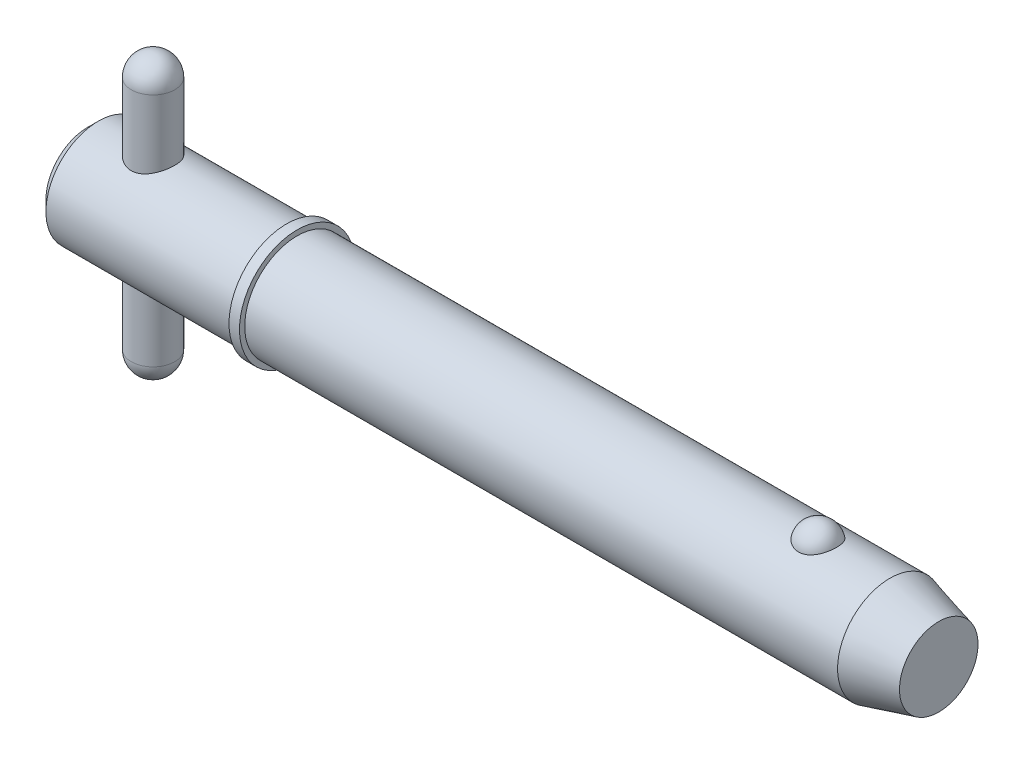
ISO-10303-21;
HEADER;
FILE_DESCRIPTION(('STEP AP214'),'2;1');
FILE_NAME('part.step','',(''),(''),'','','');
FILE_SCHEMA(('AUTOMOTIVE_DESIGN { 1 0 10303 214 1 1 1 1 }'));
ENDSEC;
DATA;
#1=APPLICATION_CONTEXT('core data for automotive mechanical design processes');
#2=APPLICATION_PROTOCOL_DEFINITION('international standard','automotive_design',2000,#1);
#3=PRODUCT_CONTEXT('',#1,'mechanical');
#4=PRODUCT('Part','Part','',(#3));
#5=PRODUCT_RELATED_PRODUCT_CATEGORY('part','',(#4));
#6=PRODUCT_DEFINITION_FORMATION('','',#4);
#7=PRODUCT_DEFINITION_CONTEXT('part definition',#1,'design');
#8=PRODUCT_DEFINITION('design','',#6,#7);
#9=PRODUCT_DEFINITION_SHAPE('','',#8);
#10=(LENGTH_UNIT() NAMED_UNIT(*) SI_UNIT(.MILLI.,.METRE.));
#11=(NAMED_UNIT(*) PLANE_ANGLE_UNIT() SI_UNIT($,.RADIAN.));
#12=(NAMED_UNIT(*) SI_UNIT($,.STERADIAN.) SOLID_ANGLE_UNIT());
#13=UNCERTAINTY_MEASURE_WITH_UNIT(LENGTH_MEASURE(1.E-05),#10,'distance_accuracy_value','');
#14=(GEOMETRIC_REPRESENTATION_CONTEXT(3) GLOBAL_UNCERTAINTY_ASSIGNED_CONTEXT((#13)) GLOBAL_UNIT_ASSIGNED_CONTEXT((#10,
#11,#12)) REPRESENTATION_CONTEXT('',''));
#15=CARTESIAN_POINT('',(0.,0.,0.));
#16=DIRECTION('',(0.,0.,1.));
#17=DIRECTION('',(1.,0.,0.));
#18=AXIS2_PLACEMENT_3D('',#15,#16,#17);
#19=CARTESIAN_POINT('',(5.94,12.7,0.));
#20=DIRECTION('',(0.,-1.,0.));
#21=DIRECTION('',(0.,0.,-1.));
#22=AXIS2_PLACEMENT_3D('',#19,#20,#21);
#23=CYLINDRICAL_SURFACE('',#22,1.98);
#24=CARTESIAN_POINT('',(5.94,-10.72,0.));
#25=DIRECTION('',(0.,-1.,0.));
#26=DIRECTION('',(0.,0.,-1.));
#27=AXIS2_PLACEMENT_3D('',#24,#25,#26);
#28=CIRCLE('',#27,1.98);
#29=CARTESIAN_POINT('',(5.94,-10.72,-1.98));
#30=VERTEX_POINT('',#29);
#31=EDGE_CURVE('P0_E10',#30,#30,#28,.F.);
#32=ORIENTED_EDGE('',*,*,#31,.T.);
#33=EDGE_LOOP('',(#32));
#34=FACE_BOUND('',#33,.T.);
#35=CARTESIAN_POINT('',(5.94,10.72,0.));
#36=DIRECTION('',(0.,-1.,0.));
#37=DIRECTION('',(0.,0.,-1.));
#38=AXIS2_PLACEMENT_3D('',#35,#36,#37);
#39=CIRCLE('',#38,1.98);
#40=CARTESIAN_POINT('',(5.94,10.72,-1.98));
#41=VERTEX_POINT('',#40);
#42=EDGE_CURVE('P0_E21',#41,#41,#39,.T.);
#43=ORIENTED_EDGE('',*,*,#42,.T.);
#44=EDGE_LOOP('',(#43));
#45=FACE_BOUND('',#44,.T.);
#46=ADVANCED_FACE('P0_F14',(#34,#45),#23,.T.);
#47=CARTESIAN_POINT('',(5.94,-10.72,0.));
#48=DIRECTION('',(0.,0.,1.));
#49=DIRECTION('',(1.,0.,0.));
#50=AXIS2_PLACEMENT_3D('',#47,#48,#49);
#51=SPHERICAL_SURFACE('',#50,1.98);
#52=CARTESIAN_POINT('',(5.94,-10.72,0.));
#53=DIRECTION('',(0.,-1.,0.));
#54=DIRECTION('',(0.,0.,-1.));
#55=AXIS2_PLACEMENT_3D('',#52,#53,#54);
#56=SPHERICAL_SURFACE('',#55,1.98);
#57=ORIENTED_EDGE('',*,*,#31,.F.);
#58=EDGE_LOOP('',(#57));
#59=FACE_BOUND('',#58,.T.);
#60=ADVANCED_FACE('P0_F29',(#59),#56,.T.);
#61=CARTESIAN_POINT('',(5.94,10.72,0.));
#62=DIRECTION('',(0.,0.,1.));
#63=DIRECTION('',(1.,0.,0.));
#64=AXIS2_PLACEMENT_3D('',#61,#62,#63);
#65=SPHERICAL_SURFACE('',#64,1.98);
#66=CARTESIAN_POINT('',(5.94,10.72,0.));
#67=DIRECTION('',(0.,-1.,0.));
#68=DIRECTION('',(0.,0.,-1.));
#69=AXIS2_PLACEMENT_3D('',#66,#67,#68);
#70=SPHERICAL_SURFACE('',#69,1.98);
#71=ORIENTED_EDGE('',*,*,#42,.F.);
#72=EDGE_LOOP('',(#71));
#73=FACE_BOUND('',#72,.T.);
#74=ADVANCED_FACE('P0_F16',(#73),#70,.T.);
#75=CLOSED_SHELL('',(#46,#60,#74));
#76=MANIFOLD_SOLID_BREP('P0_B1',#75);
#77=CARTESIAN_POINT('',(0.,0.,0.));
#78=DIRECTION('',(1.,0.,0.));
#79=DIRECTION('',(0.,0.,-1.));
#80=AXIS2_PLACEMENT_3D('',#77,#78,#79);
#81=CYLINDRICAL_SURFACE('',#80,4.765);
#82=CARTESIAN_POINT('',(73.0241944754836,0.,0.));
#83=DIRECTION('',(1.,0.,0.));
#84=DIRECTION('',(0.,0.,-1.));
#85=AXIS2_PLACEMENT_3D('',#82,#83,#84);
#86=CIRCLE('',#85,4.765);
#87=CARTESIAN_POINT('',(73.0241944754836,0.,-4.765));
#88=VERTEX_POINT('',#87);
#89=EDGE_CURVE('P1_E81',#88,#88,#86,.T.);
#90=ORIENTED_EDGE('',*,*,#89,.F.);
#91=EDGE_LOOP('',(#90));
#92=FACE_BOUND('',#91,.T.);
#93=CARTESIAN_POINT('',(19.05,0.,0.));
#94=DIRECTION('',(1.,0.,0.));
#95=DIRECTION('',(0.,0.,-1.));
#96=AXIS2_PLACEMENT_3D('',#93,#94,#95);
#97=CIRCLE('',#96,4.765);
#98=CARTESIAN_POINT('',(19.05,0.,-4.765));
#99=VERTEX_POINT('',#98);
#100=EDGE_CURVE('P1_E85',#99,#99,#97,.T.);
#101=ORIENTED_EDGE('',*,*,#100,.T.);
#102=EDGE_LOOP('',(#101));
#103=FACE_BOUND('',#102,.T.);
#104=CARTESIAN_POINT('',(66.471020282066,4.42764777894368,1.76101111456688));
#105=CARTESIAN_POINT('',(66.3797212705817,4.42764470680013,1.76101422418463));
#106=CARTESIAN_POINT('',(66.2884468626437,4.43059091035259,1.75366340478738));
#107=CARTESIAN_POINT('',(66.108615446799,4.44201846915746,1.72451180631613));
#108=CARTESIAN_POINT('',(66.0200577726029,4.45049845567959,1.70271460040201));
#109=CARTESIAN_POINT('',(65.8482570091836,4.47200516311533,1.6453937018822));
#110=CARTESIAN_POINT('',(65.7650064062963,4.48502527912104,1.60988994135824));
#111=CARTESIAN_POINT('',(65.6057633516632,4.51419542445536,1.52617873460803));
#112=CARTESIAN_POINT('',(65.5297723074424,4.53034605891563,1.47796883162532));
#113=CARTESIAN_POINT('',(65.3847445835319,4.5645931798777,1.36860494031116));
#114=CARTESIAN_POINT('',(65.3159645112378,4.58273170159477,1.30712420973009));
#115=CARTESIAN_POINT('',(65.1893423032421,4.61870302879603,1.1737020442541));
#116=CARTESIAN_POINT('',(65.1315021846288,4.63653577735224,1.1017586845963));
#117=CARTESIAN_POINT('',(65.0255709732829,4.67090140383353,0.945806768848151));
#118=CARTESIAN_POINT('',(64.9780305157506,4.68734068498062,0.861402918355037));
#119=CARTESIAN_POINT('',(64.8970817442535,4.71628466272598,0.685442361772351));
#120=CARTESIAN_POINT('',(64.8636747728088,4.72878898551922,0.593884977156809));
#121=CARTESIAN_POINT('',(64.811287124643,4.74874061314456,0.404781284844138));
#122=CARTESIAN_POINT('',(64.7925178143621,4.75611366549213,0.30716844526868));
#123=CARTESIAN_POINT('',(64.7705846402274,4.76475393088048,0.109940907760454));
#124=CARTESIAN_POINT('',(64.7674205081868,4.76602124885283,0.0103262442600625));
#125=CARTESIAN_POINT('',(64.7767405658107,4.76232928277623,-0.187629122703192));
#126=CARTESIAN_POINT('',(64.7891588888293,4.7573962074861,-0.285973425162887));
#127=CARTESIAN_POINT('',(64.8292804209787,4.74184975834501,-0.47902728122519));
#128=CARTESIAN_POINT('',(64.8569839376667,4.7312362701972,-0.573736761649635));
#129=CARTESIAN_POINT('',(64.9271581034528,4.70540026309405,-0.756973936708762));
#130=CARTESIAN_POINT('',(64.9696460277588,4.69017235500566,-0.845494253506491));
#131=CARTESIAN_POINT('',(65.068520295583,4.6566986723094,-1.01378033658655));
#132=CARTESIAN_POINT('',(65.1249076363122,4.63845268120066,-1.09354547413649));
#133=CARTESIAN_POINT('',(65.250552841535,4.60085438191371,-1.24228523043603));
#134=CARTESIAN_POINT('',(65.3198439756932,4.58149930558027,-1.31123108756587));
#135=CARTESIAN_POINT('',(65.4696066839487,4.54391653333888,-1.43607409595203));
#136=CARTESIAN_POINT('',(65.5500771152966,4.52568872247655,-1.49197257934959));
#137=CARTESIAN_POINT('',(65.7181500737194,4.49293007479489,-1.58786764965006));
#138=CARTESIAN_POINT('',(65.8055445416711,4.47832346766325,-1.62820219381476));
#139=CARTESIAN_POINT('',(65.9865534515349,4.45406011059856,-1.69345757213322));
#140=CARTESIAN_POINT('',(66.0801655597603,4.44440151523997,-1.71838415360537));
#141=CARTESIAN_POINT('',(66.2658939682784,4.43159888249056,-1.75112843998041));
#142=CARTESIAN_POINT('',(66.357849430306,4.42815213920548,-1.75974223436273));
#143=CARTESIAN_POINT('',(66.5419658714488,4.427247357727,-1.76201865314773));
#144=CARTESIAN_POINT('',(66.6341268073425,4.42978816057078,-1.7556841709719));
#145=CARTESIAN_POINT('',(66.8131292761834,4.4403864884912,-1.72869560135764));
#146=CARTESIAN_POINT('',(66.9000474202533,4.44827555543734,-1.70847853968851));
#147=CARTESIAN_POINT('',(67.0691314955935,4.46852246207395,-1.65479562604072));
#148=CARTESIAN_POINT('',(67.1512970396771,4.48088066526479,-1.62132869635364));
#149=CARTESIAN_POINT('',(67.3105916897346,4.50907357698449,-1.54120560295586));
#150=CARTESIAN_POINT('',(67.3875700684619,4.52497884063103,-1.49427526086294));
#151=CARTESIAN_POINT('',(67.5327080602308,4.55845148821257,-1.38881222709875));
#152=CARTESIAN_POINT('',(67.6008656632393,4.57601924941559,-1.33027689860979));
#153=CARTESIAN_POINT('',(67.7300990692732,4.61196537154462,-1.19991049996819));
#154=CARTESIAN_POINT('',(67.7906562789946,4.63034074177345,-1.12756415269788));
#155=CARTESIAN_POINT('',(67.8992797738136,4.66513959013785,-0.973612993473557));
#156=CARTESIAN_POINT('',(67.9473438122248,4.68156271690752,-0.892006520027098));
#157=CARTESIAN_POINT('',(68.031383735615,4.71130224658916,-0.718892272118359));
#158=CARTESIAN_POINT('',(68.0669185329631,4.724501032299,-0.627149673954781));
#159=CARTESIAN_POINT('',(68.1229522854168,4.74571823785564,-0.438611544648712));
#160=CARTESIAN_POINT('',(68.143450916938,4.75373654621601,-0.341815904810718));
#161=CARTESIAN_POINT('',(68.1690338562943,4.76378905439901,-0.145633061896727));
#162=CARTESIAN_POINT('',(68.174076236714,4.76580697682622,-0.0462395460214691));
#163=CARTESIAN_POINT('',(68.1685239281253,4.76360573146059,0.152038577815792));
#164=CARTESIAN_POINT('',(68.1579294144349,4.75938663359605,0.250923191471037));
#165=CARTESIAN_POINT('',(68.1213875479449,4.74516937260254,0.445004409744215));
#166=CARTESIAN_POINT('',(68.0954964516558,4.73519238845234,0.54021317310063));
#167=CARTESIAN_POINT('',(68.0289273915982,4.7104939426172,0.724662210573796));
#168=CARTESIAN_POINT('',(67.988248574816,4.69577220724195,0.81390214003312));
#169=CARTESIAN_POINT('',(67.8927177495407,4.66303767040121,0.984313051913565));
#170=CARTESIAN_POINT('',(67.8378042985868,4.64501070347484,1.06544688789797));
#171=CARTESIAN_POINT('',(67.7150496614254,4.60764678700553,1.21692673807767));
#172=CARTESIAN_POINT('',(67.6472086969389,4.58830985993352,1.2872729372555));
#173=CARTESIAN_POINT('',(67.5005480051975,4.55060370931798,1.41479271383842));
#174=CARTESIAN_POINT('',(67.4217918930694,4.53222967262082,1.47203785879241));
#175=CARTESIAN_POINT('',(67.2549890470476,4.49849576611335,1.57212016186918));
#176=CARTESIAN_POINT('',(67.1669417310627,4.48313608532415,1.61495641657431));
#177=CARTESIAN_POINT('',(66.9797918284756,4.45676184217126,1.68642657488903));
#178=CARTESIAN_POINT('',(66.8803653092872,4.44598302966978,1.71430590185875));
#179=CARTESIAN_POINT('',(66.6776210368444,4.43142918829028,1.75159258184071));
#180=CARTESIAN_POINT('',(66.5743049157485,4.42765125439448,1.76100759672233));
#181=CARTESIAN_POINT('',(66.471020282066,4.42764777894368,1.76101111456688));
#182=B_SPLINE_CURVE_WITH_KNOTS('',3,(#104,#105,#106,#107,#108,#109,#110,#111,#112,#113,#114,
#115,#116,#117,#118,#119,#120,#121,#122,#123,#124,#125,#126,#127,#128,#129,#130,#131,#132,#133,
#134,#135,#136,#137,#138,#139,#140,#141,#142,#143,#144,#145,#146,#147,#148,#149,#150,#151,#152,
#153,#154,#155,#156,#157,#158,#159,#160,#161,#162,#163,#164,#165,#166,#167,#168,#169,#170,#171,
#172,#173,#174,#175,#176,#177,#178,#179,#180,#181),.UNSPECIFIED.,.T.,.F.,(4,2,2,2,2,2,2,2,2,2,2,
2,2,2,2,2,2,2,2,2,2,2,2,2,2,2,2,2,2,2,2,2,2,2,2,2,2,2,4),(0.,0.273517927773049,
0.546968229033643,0.820022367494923,1.09312934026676,1.37393946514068,1.65480131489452,
1.94820420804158,2.24163496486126,2.53922817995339,2.83681628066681,3.13315071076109,
3.42949110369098,3.72617893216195,4.02288805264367,4.32037303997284,4.61782764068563,
4.9084009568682,5.19886582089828,5.4747485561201,5.75057789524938,6.01809977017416,
6.2856434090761,6.55907787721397,6.83257454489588,7.11962987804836,7.40673679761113,
7.70312663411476,7.99952284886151,8.29672237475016,8.59391856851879,8.89002850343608,
9.18615552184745,9.483582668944,9.78100471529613,10.0767610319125,10.3725358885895,
10.6820893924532,10.991514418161),.UNSPECIFIED.);
#183=CARTESIAN_POINT('',(66.471020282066,4.42764777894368,1.76101111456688));
#184=VERTEX_POINT('',#183);
#185=EDGE_CURVE('P1_E35',#184,#184,#182,.T.);
#186=ORIENTED_EDGE('',*,*,#185,.T.);
#187=EDGE_LOOP('',(#186));
#188=FACE_BOUND('',#187,.T.);
#189=ADVANCED_FACE('P1_F13',(#92,#103,#188),#81,.T.);
#190=CARTESIAN_POINT('',(0.,0.,0.));
#191=DIRECTION('',(-1.,0.,0.));
#192=DIRECTION('',(0.,0.,1.));
#193=AXIS2_PLACEMENT_3D('',#190,#191,#192);
#194=PLANE('',#193);
#195=CARTESIAN_POINT('',(0.,0.,0.));
#196=DIRECTION('',(1.,0.,0.));
#197=DIRECTION('',(0.,0.,-1.));
#198=AXIS2_PLACEMENT_3D('',#195,#196,#197);
#199=CIRCLE('',#198,3.812);
#200=CARTESIAN_POINT('',(0.,0.,-3.812));
#201=VERTEX_POINT('',#200);
#202=EDGE_CURVE('P1_E9',#201,#201,#199,.T.);
#203=ORIENTED_EDGE('',*,*,#202,.F.);
#204=EDGE_LOOP('',(#203));
#205=FACE_BOUND('',#204,.T.);
#206=ADVANCED_FACE('P1_F15',(#205),#194,.T.);
#207=CARTESIAN_POINT('',(0.952999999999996,0.,0.));
#208=DIRECTION('',(1.,0.,0.));
#209=DIRECTION('',(0.,0.,-1.));
#210=AXIS2_PLACEMENT_3D('',#207,#208,#209);
#211=CONICAL_SURFACE('',#210,4.765,0.78539816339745);
#212=ORIENTED_EDGE('',*,*,#202,.T.);
#213=EDGE_LOOP('',(#212));
#214=FACE_BOUND('',#213,.T.);
#215=CARTESIAN_POINT('',(0.952999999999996,0.,0.));
#216=DIRECTION('',(1.,0.,0.));
#217=DIRECTION('',(0.,0.,-1.));
#218=AXIS2_PLACEMENT_3D('',#215,#216,#217);
#219=CIRCLE('',#218,4.765);
#220=CARTESIAN_POINT('',(0.952999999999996,0.,-4.765));
#221=VERTEX_POINT('',#220);
#222=EDGE_CURVE('P1_E26',#221,#221,#219,.T.);
#223=ORIENTED_EDGE('',*,*,#222,.F.);
#224=EDGE_LOOP('',(#223));
#225=FACE_BOUND('',#224,.T.);
#226=ADVANCED_FACE('P1_F77',(#214,#225),#211,.T.);
#227=CARTESIAN_POINT('',(0.,0.,0.));
#228=DIRECTION('',(1.,0.,0.));
#229=DIRECTION('',(0.,0.,-1.));
#230=AXIS2_PLACEMENT_3D('',#227,#228,#229);
#231=CYLINDRICAL_SURFACE('',#230,4.765);
#232=CARTESIAN_POINT('',(5.94,-4.33414639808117,1.98));
#233=CARTESIAN_POINT('',(5.83435484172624,-4.33415447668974,1.97999169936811));
#234=CARTESIAN_POINT('',(5.72854887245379,-4.33806396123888,1.97149330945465));
#235=CARTESIAN_POINT('',(5.51998191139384,-4.35319906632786,1.93783487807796));
#236=CARTESIAN_POINT('',(5.41723000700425,-4.3644446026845,1.91262947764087));
#237=CARTESIAN_POINT('',(5.21817294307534,-4.39274225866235,1.84670269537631));
#238=CARTESIAN_POINT('',(5.12184344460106,-4.40977076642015,1.80604432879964));
#239=CARTESIAN_POINT('',(4.93740039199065,-4.44768106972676,1.71055160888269));
#240=CARTESIAN_POINT('',(4.84928487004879,-4.46856193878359,1.65572066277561));
#241=CARTESIAN_POINT('',(4.67826533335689,-4.51326966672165,1.52981120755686));
#242=CARTESIAN_POINT('',(4.59593118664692,-4.53719608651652,1.45799365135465));
#243=CARTESIAN_POINT('',(4.44405452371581,-4.58448035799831,1.30170177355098));
#244=CARTESIAN_POINT('',(4.37451692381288,-4.60783798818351,1.21722260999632));
#245=CARTESIAN_POINT('',(4.24730683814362,-4.65256187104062,1.03353484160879));
#246=CARTESIAN_POINT('',(4.19027484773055,-4.67379892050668,0.933848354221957));
#247=CARTESIAN_POINT('',(4.0940363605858,-4.7106711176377,0.7252544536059));
#248=CARTESIAN_POINT('',(4.05482199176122,-4.72630873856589,0.61635113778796));
#249=CARTESIAN_POINT('',(3.99739515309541,-4.74951416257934,0.398397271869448));
#250=CARTESIAN_POINT('',(3.97820018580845,-4.7574579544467,0.289646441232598));
#251=CARTESIAN_POINT('',(3.95818309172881,-4.76574596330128,0.0701967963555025));
#252=CARTESIAN_POINT('',(3.95735355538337,-4.76609324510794,-0.0405012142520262));
#253=CARTESIAN_POINT('',(3.9735743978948,-4.75937098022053,-0.253561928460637));
#254=CARTESIAN_POINT('',(3.98954548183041,-4.75274912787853,-0.356023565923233));
#255=CARTESIAN_POINT('',(4.03706504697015,-4.73344665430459,-0.556659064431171));
#256=CARTESIAN_POINT('',(4.06861467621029,-4.72076558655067,-0.654832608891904));
#257=CARTESIAN_POINT('',(4.14677192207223,-4.69032846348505,-0.845904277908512));
#258=CARTESIAN_POINT('',(4.19360181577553,-4.67249797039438,-0.938699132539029));
#259=CARTESIAN_POINT('',(4.30077315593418,-4.63350852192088,-1.11535616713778));
#260=CARTESIAN_POINT('',(4.3611193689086,-4.61234839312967,-1.19921518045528));
#261=CARTESIAN_POINT('',(4.49853487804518,-4.56707259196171,-1.3618711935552));
#262=CARTESIAN_POINT('',(4.57648039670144,-4.5428537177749,-1.43990029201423));
#263=CARTESIAN_POINT('',(4.74440779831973,-4.49530722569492,-1.58211009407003));
#264=CARTESIAN_POINT('',(4.83439425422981,-4.47197995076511,-1.64628551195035));
#265=CARTESIAN_POINT('',(5.02755026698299,-4.42812342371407,-1.76092221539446));
#266=CARTESIAN_POINT('',(5.13105348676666,-4.40770990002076,-1.81086937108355));
#267=CARTESIAN_POINT('',(5.34607555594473,-4.37336901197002,-1.89231211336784));
#268=CARTESIAN_POINT('',(5.45758864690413,-4.3594370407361,-1.92382080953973));
#269=CARTESIAN_POINT('',(5.67777275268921,-4.34077746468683,-1.96554536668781));
#270=CARTESIAN_POINT('',(5.78616167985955,-4.33551319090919,-1.9770057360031));
#271=CARTESIAN_POINT('',(6.00341835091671,-4.33325118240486,-1.98196183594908));
#272=CARTESIAN_POINT('',(6.11228591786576,-4.33625061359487,-1.97546372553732));
#273=CARTESIAN_POINT('',(6.32012423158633,-4.34962383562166,-1.94582288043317));
#274=CARTESIAN_POINT('',(6.41928436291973,-4.35951709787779,-1.92376364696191));
#275=CARTESIAN_POINT('',(6.61241543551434,-4.38495043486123,-1.86506038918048));
#276=CARTESIAN_POINT('',(6.70638516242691,-4.40049182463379,-1.82841296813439));
#277=CARTESIAN_POINT('',(6.89090272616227,-4.43627016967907,-1.73985559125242));
#278=CARTESIAN_POINT('',(6.98113841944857,-4.45667771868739,-1.68736639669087));
#279=CARTESIAN_POINT('',(7.1519532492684,-4.49964530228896,-1.56919282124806));
#280=CARTESIAN_POINT('',(7.232528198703,-4.52220626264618,-1.50350275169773));
#281=CARTESIAN_POINT('',(7.38851617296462,-4.56914071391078,-1.35452895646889));
#282=CARTESIAN_POINT('',(7.46298462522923,-4.5935132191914,-1.27025197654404));
#283=CARTESIAN_POINT('',(7.59689029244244,-4.63962841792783,-1.08983181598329));
#284=CARTESIAN_POINT('',(7.65632644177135,-4.66137092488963,-0.993687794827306));
#285=CARTESIAN_POINT('',(7.75840361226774,-4.69991192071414,-0.791608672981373));
#286=CARTESIAN_POINT('',(7.80100481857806,-4.71669866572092,-0.685651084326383));
#287=CARTESIAN_POINT('',(7.86746997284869,-4.74331408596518,-0.467197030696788));
#288=CARTESIAN_POINT('',(7.8913450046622,-4.75314687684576,-0.354704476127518));
#289=CARTESIAN_POINT('',(7.91828971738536,-4.76427543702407,-0.134819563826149));
#290=CARTESIAN_POINT('',(7.92269147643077,-4.76611762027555,-0.027616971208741));
#291=CARTESIAN_POINT('',(7.91414154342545,-4.76256684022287,0.185959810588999));
#292=CARTESIAN_POINT('',(7.90119286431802,-4.75717513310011,0.292334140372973));
#293=CARTESIAN_POINT('',(7.85926572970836,-4.74004856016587,0.497383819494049));
#294=CARTESIAN_POINT('',(7.83086647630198,-4.72854322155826,0.596198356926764));
#295=CARTESIAN_POINT('',(7.75947503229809,-4.70045111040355,0.787624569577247));
#296=CARTESIAN_POINT('',(7.71648006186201,-4.68386336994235,0.880235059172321));
#297=CARTESIAN_POINT('',(7.6149456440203,-4.64628321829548,1.06122875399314));
#298=CARTESIAN_POINT('',(7.55579211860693,-4.62512577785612,1.14923242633));
#299=CARTESIAN_POINT('',(7.42451813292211,-4.58091700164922,1.31443888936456));
#300=CARTESIAN_POINT('',(7.35239289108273,-4.5578649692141,1.39163767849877));
#301=CARTESIAN_POINT('',(7.19146107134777,-4.51050832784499,1.53847013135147));
#302=CARTESIAN_POINT('',(7.10185635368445,-4.48622440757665,1.60723941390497));
#303=CARTESIAN_POINT('',(6.91164948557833,-4.44076541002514,1.72888900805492));
#304=CARTESIAN_POINT('',(6.81104124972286,-4.41959206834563,1.78176046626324));
#305=CARTESIAN_POINT('',(6.60181953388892,-4.38318936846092,1.86953227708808));
#306=CARTESIAN_POINT('',(6.49325511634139,-4.3679267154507,1.90453365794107));
#307=CARTESIAN_POINT('',(6.32681512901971,-4.35102038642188,1.94268459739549));
#308=CARTESIAN_POINT('',(6.27079191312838,-4.34638447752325,1.953006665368));
#309=CARTESIAN_POINT('',(6.15793999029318,-4.33925923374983,1.96879053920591));
#310=CARTESIAN_POINT('',(6.10111188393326,-4.33676837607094,1.97425579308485));
#311=CARTESIAN_POINT('',(6.00947316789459,-4.33456308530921,1.97908711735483));
#312=CARTESIAN_POINT('',(5.97474528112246,-4.33414374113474,1.98000272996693));
#313=CARTESIAN_POINT('',(5.94,-4.33414639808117,1.98));
#314=B_SPLINE_CURVE_WITH_KNOTS('',3,(#232,#233,#234,#235,#236,#237,#238,#239,#240,#241,#242,
#243,#244,#245,#246,#247,#248,#249,#250,#251,#252,#253,#254,#255,#256,#257,#258,#259,#260,#261,
#262,#263,#264,#265,#266,#267,#268,#269,#270,#271,#272,#273,#274,#275,#276,#277,#278,#279,#280,
#281,#282,#283,#284,#285,#286,#287,#288,#289,#290,#291,#292,#293,#294,#295,#296,#297,#298,#299,
#300,#301,#302,#303,#304,#305,#306,#307,#308,#309,#310,#311,#312,#313),.UNSPECIFIED.,.T.,.F.,(4,
2,2,2,2,2,2,2,2,2,2,2,2,2,2,2,2,2,2,2,2,2,2,2,2,2,2,2,2,2,2,2,2,2,2,2,2,2,2,2,4),(0.,
0.316814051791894,0.634491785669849,0.950887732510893,1.2672076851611,1.60127705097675,
1.93547449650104,2.28407463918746,2.63252061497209,2.96292077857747,3.29318763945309,
3.60346227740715,3.91375978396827,4.22878888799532,4.54392926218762,4.88117914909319,
5.21855748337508,5.56691259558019,5.91501972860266,6.24062939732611,6.56612741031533,
6.87094948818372,7.17584258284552,7.49361276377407,7.81152017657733,8.15513975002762,
8.4987836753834,8.8432355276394,9.18748334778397,9.50777781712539,9.8280166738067,
10.1370037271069,10.4460496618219,10.7690461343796,11.0921619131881,11.4371238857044,
11.7822776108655,12.1254577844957,12.2967183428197,12.4678572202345,12.5720531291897),.UNSPECIFIED.);
#315=CARTESIAN_POINT('',(5.94,-4.33414639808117,1.98));
#316=VERTEX_POINT('',#315);
#317=EDGE_CURVE('P1_E17',#316,#316,#314,.T.);
#318=ORIENTED_EDGE('',*,*,#317,.F.);
#319=EDGE_LOOP('',(#318));
#320=FACE_BOUND('',#319,.T.);
#321=CARTESIAN_POINT('',(5.94,4.33414639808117,1.98));
#322=CARTESIAN_POINT('',(6.04564515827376,4.33415447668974,1.97999169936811));
#323=CARTESIAN_POINT('',(6.15145112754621,4.33806396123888,1.97149330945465));
#324=CARTESIAN_POINT('',(6.36001808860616,4.35319906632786,1.93783487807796));
#325=CARTESIAN_POINT('',(6.46276999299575,4.3644446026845,1.91262947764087));
#326=CARTESIAN_POINT('',(6.66182705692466,4.39274225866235,1.84670269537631));
#327=CARTESIAN_POINT('',(6.75815655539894,4.40977076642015,1.80604432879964));
#328=CARTESIAN_POINT('',(6.94259960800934,4.44768106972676,1.71055160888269));
#329=CARTESIAN_POINT('',(7.03071512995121,4.46856193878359,1.65572066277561));
#330=CARTESIAN_POINT('',(7.20173466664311,4.51326966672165,1.52981120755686));
#331=CARTESIAN_POINT('',(7.28406881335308,4.53719608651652,1.45799365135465));
#332=CARTESIAN_POINT('',(7.43594547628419,4.58448035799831,1.30170177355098));
#333=CARTESIAN_POINT('',(7.50548307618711,4.60783798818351,1.21722260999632));
#334=CARTESIAN_POINT('',(7.63269316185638,4.65256187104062,1.03353484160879));
#335=CARTESIAN_POINT('',(7.68972515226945,4.67379892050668,0.933848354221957));
#336=CARTESIAN_POINT('',(7.7859636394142,4.7106711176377,0.7252544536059));
#337=CARTESIAN_POINT('',(7.82517800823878,4.72630873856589,0.61635113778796));
#338=CARTESIAN_POINT('',(7.88260484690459,4.74951416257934,0.398397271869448));
#339=CARTESIAN_POINT('',(7.90179981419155,4.7574579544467,0.289646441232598));
#340=CARTESIAN_POINT('',(7.92181690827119,4.76574596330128,0.0701967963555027));
#341=CARTESIAN_POINT('',(7.92264644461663,4.76609324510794,-0.040501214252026));
#342=CARTESIAN_POINT('',(7.9064256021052,4.75937098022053,-0.253561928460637));
#343=CARTESIAN_POINT('',(7.89045451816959,4.75274912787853,-0.356023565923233));
#344=CARTESIAN_POINT('',(7.84293495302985,4.73344665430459,-0.55665906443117));
#345=CARTESIAN_POINT('',(7.81138532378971,4.72076558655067,-0.654832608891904));
#346=CARTESIAN_POINT('',(7.73322807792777,4.69032846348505,-0.845904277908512));
#347=CARTESIAN_POINT('',(7.68639818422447,4.67249797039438,-0.938699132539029));
#348=CARTESIAN_POINT('',(7.57922684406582,4.63350852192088,-1.11535616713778));
#349=CARTESIAN_POINT('',(7.5188806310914,4.61234839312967,-1.19921518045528));
#350=CARTESIAN_POINT('',(7.38146512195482,4.56707259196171,-1.3618711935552));
#351=CARTESIAN_POINT('',(7.30351960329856,4.5428537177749,-1.43990029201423));
#352=CARTESIAN_POINT('',(7.13559220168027,4.49530722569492,-1.58211009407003));
#353=CARTESIAN_POINT('',(7.04560574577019,4.47197995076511,-1.64628551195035));
#354=CARTESIAN_POINT('',(6.85244973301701,4.42812342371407,-1.76092221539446));
#355=CARTESIAN_POINT('',(6.74894651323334,4.40770990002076,-1.81086937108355));
#356=CARTESIAN_POINT('',(6.53392444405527,4.37336901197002,-1.89231211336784));
#357=CARTESIAN_POINT('',(6.42241135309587,4.3594370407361,-1.92382080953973));
#358=CARTESIAN_POINT('',(6.20222724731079,4.34077746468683,-1.96554536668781));
#359=CARTESIAN_POINT('',(6.09383832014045,4.33551319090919,-1.9770057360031));
#360=CARTESIAN_POINT('',(5.87658164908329,4.33325118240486,-1.98196183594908));
#361=CARTESIAN_POINT('',(5.76771408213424,4.33625061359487,-1.97546372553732));
#362=CARTESIAN_POINT('',(5.55987576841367,4.34962383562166,-1.94582288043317));
#363=CARTESIAN_POINT('',(5.46071563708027,4.35951709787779,-1.92376364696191));
#364=CARTESIAN_POINT('',(5.26758456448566,4.38495043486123,-1.86506038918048));
#365=CARTESIAN_POINT('',(5.17361483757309,4.40049182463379,-1.82841296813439));
#366=CARTESIAN_POINT('',(4.98909727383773,4.43627016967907,-1.73985559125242));
#367=CARTESIAN_POINT('',(4.89886158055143,4.45667771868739,-1.68736639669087));
#368=CARTESIAN_POINT('',(4.72804675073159,4.49964530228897,-1.56919282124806));
#369=CARTESIAN_POINT('',(4.647471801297,4.52220626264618,-1.50350275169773));
#370=CARTESIAN_POINT('',(4.49148382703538,4.56914071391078,-1.35452895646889));
#371=CARTESIAN_POINT('',(4.41701537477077,4.5935132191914,-1.27025197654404));
#372=CARTESIAN_POINT('',(4.28310970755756,4.63962841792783,-1.08983181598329));
#373=CARTESIAN_POINT('',(4.22367355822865,4.66137092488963,-0.993687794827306));
#374=CARTESIAN_POINT('',(4.12159638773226,4.69991192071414,-0.791608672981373));
#375=CARTESIAN_POINT('',(4.07899518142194,4.71669866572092,-0.685651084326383));
#376=CARTESIAN_POINT('',(4.01253002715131,4.74331408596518,-0.467197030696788));
#377=CARTESIAN_POINT('',(3.98865499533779,4.75314687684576,-0.354704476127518));
#378=CARTESIAN_POINT('',(3.96171028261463,4.76427543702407,-0.134819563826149));
#379=CARTESIAN_POINT('',(3.95730852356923,4.76611762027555,-0.0276169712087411));
#380=CARTESIAN_POINT('',(3.96585845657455,4.76256684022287,0.185959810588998));
#381=CARTESIAN_POINT('',(3.97880713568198,4.75717513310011,0.292334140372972));
#382=CARTESIAN_POINT('',(4.02073427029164,4.74004856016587,0.497383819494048));
#383=CARTESIAN_POINT('',(4.04913352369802,4.72854322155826,0.596198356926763));
#384=CARTESIAN_POINT('',(4.12052496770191,4.70045111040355,0.787624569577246));
#385=CARTESIAN_POINT('',(4.16351993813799,4.68386336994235,0.880235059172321));
#386=CARTESIAN_POINT('',(4.2650543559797,4.64628321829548,1.06122875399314));
#387=CARTESIAN_POINT('',(4.32420788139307,4.62512577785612,1.14923242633));
#388=CARTESIAN_POINT('',(4.45548186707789,4.58091700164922,1.31443888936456));
#389=CARTESIAN_POINT('',(4.52760710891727,4.5578649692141,1.39163767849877));
#390=CARTESIAN_POINT('',(4.68853892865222,4.51050832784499,1.53847013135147));
#391=CARTESIAN_POINT('',(4.77814364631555,4.48622440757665,1.60723941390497));
#392=CARTESIAN_POINT('',(4.96835051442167,4.44076541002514,1.72888900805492));
#393=CARTESIAN_POINT('',(5.06895875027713,4.41959206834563,1.78176046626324));
#394=CARTESIAN_POINT('',(5.27818046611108,4.38318936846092,1.86953227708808));
#395=CARTESIAN_POINT('',(5.38674488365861,4.3679267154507,1.90453365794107));
#396=CARTESIAN_POINT('',(5.55318487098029,4.35102038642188,1.94268459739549));
#397=CARTESIAN_POINT('',(5.60920808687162,4.34638447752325,1.953006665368));
#398=CARTESIAN_POINT('',(5.72206000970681,4.33925923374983,1.96879053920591));
#399=CARTESIAN_POINT('',(5.77888811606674,4.33676837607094,1.97425579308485));
#400=CARTESIAN_POINT('',(5.87052683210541,4.33456308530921,1.97908711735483));
#401=CARTESIAN_POINT('',(5.90525471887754,4.33414374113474,1.98000272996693));
#402=CARTESIAN_POINT('',(5.94,4.33414639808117,1.98));
#403=B_SPLINE_CURVE_WITH_KNOTS('',3,(#321,#322,#323,#324,#325,#326,#327,#328,#329,#330,#331,
#332,#333,#334,#335,#336,#337,#338,#339,#340,#341,#342,#343,#344,#345,#346,#347,#348,#349,#350,
#351,#352,#353,#354,#355,#356,#357,#358,#359,#360,#361,#362,#363,#364,#365,#366,#367,#368,#369,
#370,#371,#372,#373,#374,#375,#376,#377,#378,#379,#380,#381,#382,#383,#384,#385,#386,#387,#388,
#389,#390,#391,#392,#393,#394,#395,#396,#397,#398,#399,#400,#401,#402),.UNSPECIFIED.,.T.,.F.,(4,
2,2,2,2,2,2,2,2,2,2,2,2,2,2,2,2,2,2,2,2,2,2,2,2,2,2,2,2,2,2,2,2,2,2,2,2,2,2,2,4),(0.,
0.316814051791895,0.634491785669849,0.950887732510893,1.2672076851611,1.60127705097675,
1.93547449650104,2.28407463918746,2.63252061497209,2.96292077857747,3.29318763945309,
3.60346227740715,3.91375978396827,4.22878888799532,4.54392926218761,4.88117914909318,
5.21855748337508,5.56691259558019,5.91501972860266,6.24062939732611,6.56612741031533,
6.87094948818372,7.17584258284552,7.49361276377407,7.81152017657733,8.15513975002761,
8.4987836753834,8.84323552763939,9.18748334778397,9.50777781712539,9.8280166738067,
10.1370037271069,10.4460496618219,10.7690461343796,11.0921619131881,11.4371238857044,
11.7822776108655,12.1254577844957,12.2967183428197,12.4678572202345,12.5720531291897),.UNSPECIFIED.);
#404=CARTESIAN_POINT('',(5.94,4.33414639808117,1.98));
#405=VERTEX_POINT('',#404);
#406=EDGE_CURVE('P1_E43',#405,#405,#403,.T.);
#407=ORIENTED_EDGE('',*,*,#406,.F.);
#408=EDGE_LOOP('',(#407));
#409=FACE_BOUND('',#408,.T.);
#410=ORIENTED_EDGE('',*,*,#222,.T.);
#411=EDGE_LOOP('',(#410));
#412=FACE_BOUND('',#411,.T.);
#413=CARTESIAN_POINT('',(18.097,0.,0.));
#414=DIRECTION('',(1.,0.,0.));
#415=DIRECTION('',(0.,0.,-1.));
#416=AXIS2_PLACEMENT_3D('',#413,#414,#415);
#417=CIRCLE('',#416,4.765);
#418=CARTESIAN_POINT('',(18.097,0.,-4.765));
#419=VERTEX_POINT('',#418);
#420=EDGE_CURVE('P1_E31',#419,#419,#417,.T.);
#421=ORIENTED_EDGE('',*,*,#420,.F.);
#422=EDGE_LOOP('',(#421));
#423=FACE_BOUND('',#422,.T.);
#424=ADVANCED_FACE('P1_F103',(#320,#409,#412,#423),#231,.T.);
#425=CARTESIAN_POINT('',(18.097,4.765,0.));
#426=DIRECTION('',(-1.,0.,0.));
#427=DIRECTION('',(0.,0.,1.));
#428=AXIS2_PLACEMENT_3D('',#425,#426,#427);
#429=PLANE('',#428);
#430=ORIENTED_EDGE('',*,*,#420,.T.);
#431=EDGE_LOOP('',(#430));
#432=FACE_BOUND('',#431,.T.);
#433=CARTESIAN_POINT('',(18.097,0.,0.));
#434=DIRECTION('',(1.,0.,0.));
#435=DIRECTION('',(0.,0.,-1.));
#436=AXIS2_PLACEMENT_3D('',#433,#434,#435);
#437=CIRCLE('',#436,5.2415);
#438=CARTESIAN_POINT('',(18.097,0.,-5.2415));
#439=VERTEX_POINT('',#438);
#440=EDGE_CURVE('P1_E91',#439,#439,#437,.T.);
#441=ORIENTED_EDGE('',*,*,#440,.F.);
#442=EDGE_LOOP('',(#441));
#443=FACE_BOUND('',#442,.T.);
#444=ADVANCED_FACE('P1_F100',(#432,#443),#429,.T.);
#445=CARTESIAN_POINT('',(0.,0.,0.));
#446=DIRECTION('',(1.,0.,0.));
#447=DIRECTION('',(0.,0.,-1.));
#448=AXIS2_PLACEMENT_3D('',#445,#446,#447);
#449=CYLINDRICAL_SURFACE('',#448,5.2415);
#450=ORIENTED_EDGE('',*,*,#440,.T.);
#451=EDGE_LOOP('',(#450));
#452=FACE_BOUND('',#451,.T.);
#453=CARTESIAN_POINT('',(19.05,0.,0.));
#454=DIRECTION('',(1.,0.,0.));
#455=DIRECTION('',(0.,0.,-1.));
#456=AXIS2_PLACEMENT_3D('',#453,#454,#455);
#457=CIRCLE('',#456,5.2415);
#458=CARTESIAN_POINT('',(19.05,0.,-5.2415));
#459=VERTEX_POINT('',#458);
#460=EDGE_CURVE('P1_E88',#459,#459,#457,.T.);
#461=ORIENTED_EDGE('',*,*,#460,.F.);
#462=EDGE_LOOP('',(#461));
#463=FACE_BOUND('',#462,.T.);
#464=ADVANCED_FACE('P1_F68',(#452,#463),#449,.T.);
#465=CARTESIAN_POINT('',(19.05,5.2415,0.));
#466=DIRECTION('',(1.,0.,0.));
#467=DIRECTION('',(0.,0.,-1.));
#468=AXIS2_PLACEMENT_3D('',#465,#466,#467);
#469=PLANE('',#468);
#470=ORIENTED_EDGE('',*,*,#460,.T.);
#471=EDGE_LOOP('',(#470));
#472=FACE_BOUND('',#471,.T.);
#473=ORIENTED_EDGE('',*,*,#100,.F.);
#474=EDGE_LOOP('',(#473));
#475=FACE_BOUND('',#474,.T.);
#476=ADVANCED_FACE('P1_F62',(#472,#475),#469,.T.);
#477=CARTESIAN_POINT('',(77.47,0.,0.));
#478=DIRECTION('',(-1.,0.,0.));
#479=DIRECTION('',(0.,0.,1.));
#480=AXIS2_PLACEMENT_3D('',#477,#478,#479);
#481=CONICAL_SURFACE('',#480,3.57375000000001,0.26179938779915);
#482=ORIENTED_EDGE('',*,*,#89,.T.);
#483=EDGE_LOOP('',(#482));
#484=FACE_BOUND('',#483,.T.);
#485=CARTESIAN_POINT('',(77.47,0.,0.));
#486=DIRECTION('',(1.,0.,0.));
#487=DIRECTION('',(0.,0.,-1.));
#488=AXIS2_PLACEMENT_3D('',#485,#486,#487);
#489=CIRCLE('',#488,3.57375000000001);
#490=CARTESIAN_POINT('',(77.47,0.,-3.57375000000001));
#491=VERTEX_POINT('',#490);
#492=EDGE_CURVE('P1_E42',#491,#491,#489,.T.);
#493=ORIENTED_EDGE('',*,*,#492,.F.);
#494=EDGE_LOOP('',(#493));
#495=FACE_BOUND('',#494,.T.);
#496=ADVANCED_FACE('P1_F59',(#484,#495),#481,.T.);
#497=CARTESIAN_POINT('',(77.47,3.57375000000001,0.));
#498=DIRECTION('',(1.,0.,0.));
#499=DIRECTION('',(0.,0.,-1.));
#500=AXIS2_PLACEMENT_3D('',#497,#498,#499);
#501=PLANE('',#500);
#502=ORIENTED_EDGE('',*,*,#492,.T.);
#503=EDGE_LOOP('',(#502));
#504=FACE_BOUND('',#503,.T.);
#505=ADVANCED_FACE('P1_F55',(#504),#501,.T.);
#506=CARTESIAN_POINT('',(66.471020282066,4.2885,0.));
#507=DIRECTION('',(-1.,0.,0.));
#508=DIRECTION('',(0.,1.,0.));
#509=AXIS2_PLACEMENT_3D('',#506,#507,#508);
#510=SPHERICAL_SURFACE('',#509,1.7665);
#511=ORIENTED_EDGE('',*,*,#185,.F.);
#512=EDGE_LOOP('',(#511));
#513=FACE_BOUND('',#512,.T.);
#514=ADVANCED_FACE('P1_F50',(#513),#510,.T.);
#515=CARTESIAN_POINT('',(5.94,-5.2415,0.));
#516=DIRECTION('',(0.,1.,0.));
#517=DIRECTION('',(0.,0.,1.));
#518=AXIS2_PLACEMENT_3D('',#515,#516,#517);
#519=CYLINDRICAL_SURFACE('',#518,1.98);
#520=ORIENTED_EDGE('',*,*,#317,.T.);
#521=EDGE_LOOP('',(#520));
#522=FACE_BOUND('',#521,.T.);
#523=ORIENTED_EDGE('',*,*,#406,.T.);
#524=EDGE_LOOP('',(#523));
#525=FACE_BOUND('',#524,.T.);
#526=ADVANCED_FACE('P1_F54',(#522,#525),#519,.F.);
#527=CLOSED_SHELL('',(#189,#206,#226,#424,#444,#464,#476,#496,#505,#514,#526));
#528=MANIFOLD_SOLID_BREP('P1_B1',#527);
#529=ADVANCED_BREP_SHAPE_REPRESENTATION('',(#18,#76,#528),#14);
#530=SHAPE_DEFINITION_REPRESENTATION(#9,#529);
ENDSEC;
END-ISO-10303-21;
